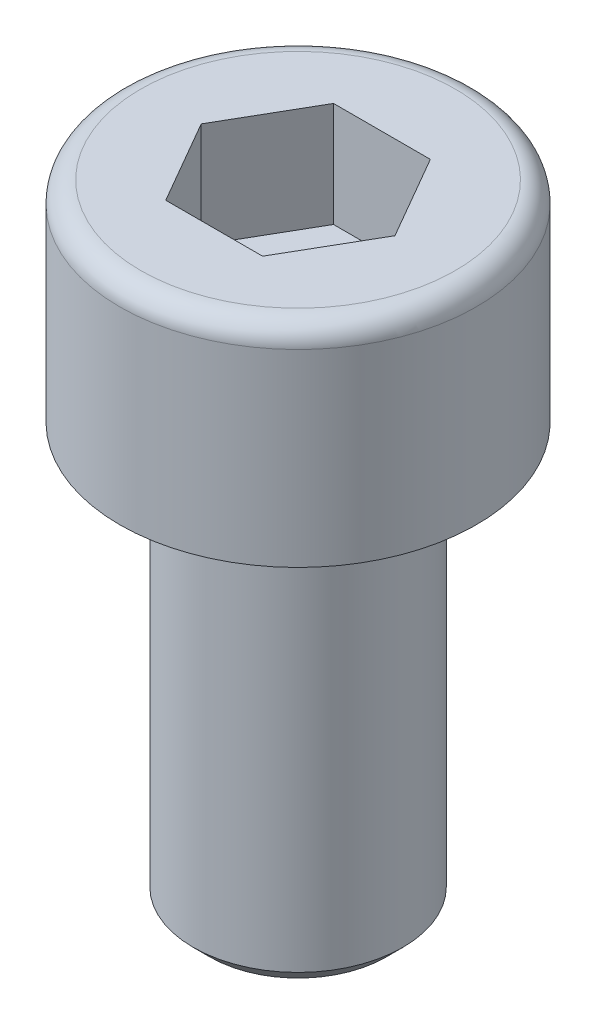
from build123d import *

# Parameters (mm, degrees)
ENL_V_MAT_EXTRU_1_DEPTH = 2.5
CHANFREIN1_SIZE         = 0.4


with BuildPart() as part:
    # Esquisse1 → Base-R_volution (revolve)
    with BuildSketch(Plane.XY, mode=Mode.PRIVATE) as base_r_volution_sk:
        with BuildLine():
            Line((0, 15), (-3.75, 15))
            ThreePointArc((-3.75, 15), (-4.103553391, 14.853553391), (-4.25, 14.5))
            Line((-4.25, 14.5), (-4.25, 10))
            Line((-4.25, 10), (-2.5, 10))
            Line((-2.5, 10), (-2.5, 0))
            Line((-2.5, 0), (0, 0))
            Line((0, 0), (0, 15))
        make_face()
    revolve(base_r_volution_sk.sketch.rotate(Axis((0, 17.657793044, 0), (0, -1, 0)), 270), axis=Axis((0, 17.657793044, 0), (0, -1, 0)))

    # Esquisse2 → Enl_v. mat.-Extru.1 (cut)
    with BuildSketch(Plane(origin=(0, 15, 0), x_dir=(-1, 0, 0), z_dir=(0, 1, 0))):
        Polygon((-1.154700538, -2), (1.154700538, -2), (2.309401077, 0), (1.154700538, 2), (-1.154700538, 2), (-2.309401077, 0), align=None)
    extrude(amount=-ENL_V_MAT_EXTRU_1_DEPTH, mode=Mode.SUBTRACT)

    # Chanfrein1
    chanfrein1_edges = [part.edges().sort_by_distance(p)[0] for p in [
        (0, 0, -2.5),
    ]]
    chamfer(chanfrein1_edges, length=CHANFREIN1_SIZE)


solid = part.part
